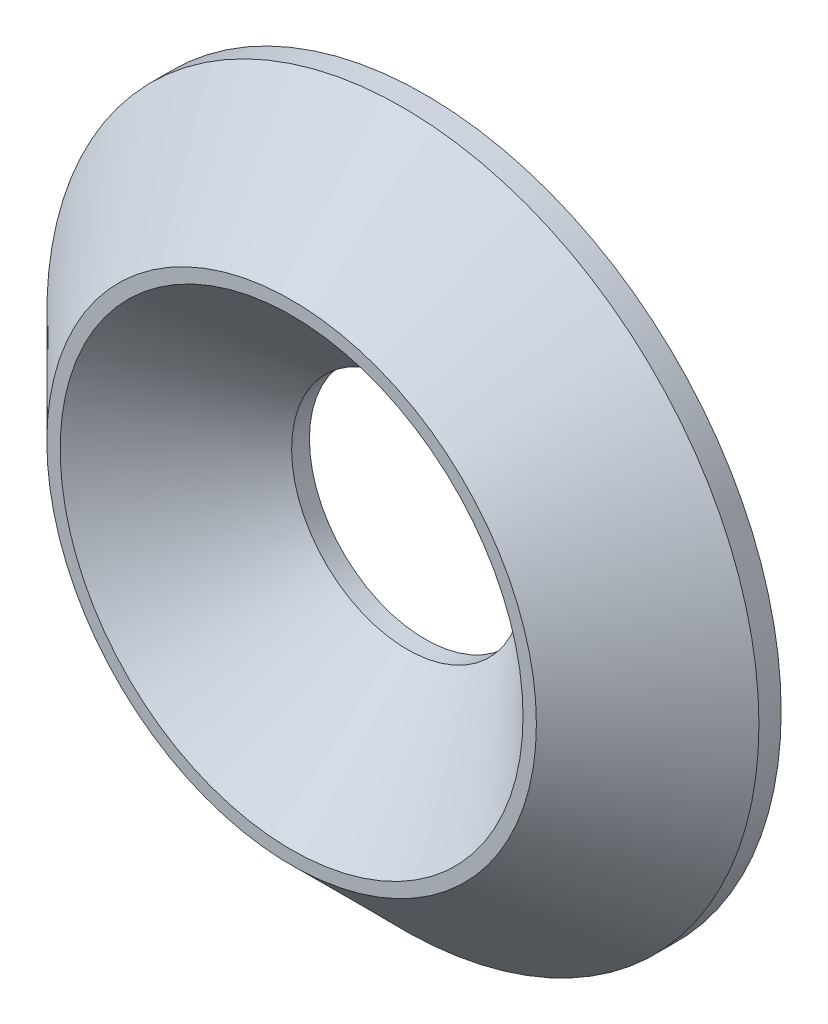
ISO-10303-21;
HEADER;
FILE_DESCRIPTION(('STEP AP214'),'2;1');
FILE_NAME('part.step','',(''),(''),'','','');
FILE_SCHEMA(('AUTOMOTIVE_DESIGN { 1 0 10303 214 1 1 1 1 }'));
ENDSEC;
DATA;
#1=APPLICATION_CONTEXT('core data for automotive mechanical design processes');
#2=APPLICATION_PROTOCOL_DEFINITION('international standard','automotive_design',2000,#1);
#3=PRODUCT_CONTEXT('',#1,'mechanical');
#4=PRODUCT('Part','Part','',(#3));
#5=PRODUCT_RELATED_PRODUCT_CATEGORY('part','',(#4));
#6=PRODUCT_DEFINITION_FORMATION('','',#4);
#7=PRODUCT_DEFINITION_CONTEXT('part definition',#1,'design');
#8=PRODUCT_DEFINITION('design','',#6,#7);
#9=PRODUCT_DEFINITION_SHAPE('','',#8);
#10=(LENGTH_UNIT() NAMED_UNIT(*) SI_UNIT(.MILLI.,.METRE.));
#11=(NAMED_UNIT(*) PLANE_ANGLE_UNIT() SI_UNIT($,.RADIAN.));
#12=(NAMED_UNIT(*) SI_UNIT($,.STERADIAN.) SOLID_ANGLE_UNIT());
#13=UNCERTAINTY_MEASURE_WITH_UNIT(LENGTH_MEASURE(1.E-05),#10,'distance_accuracy_value','');
#14=(GEOMETRIC_REPRESENTATION_CONTEXT(3) GLOBAL_UNCERTAINTY_ASSIGNED_CONTEXT((#13)) GLOBAL_UNIT_ASSIGNED_CONTEXT((#10,
#11,#12)) REPRESENTATION_CONTEXT('',''));
#15=CARTESIAN_POINT('',(0.,0.,0.));
#16=DIRECTION('',(0.,0.,1.));
#17=DIRECTION('',(1.,0.,0.));
#18=AXIS2_PLACEMENT_3D('',#15,#16,#17);
#19=CARTESIAN_POINT('',(0.,0.,3.));
#20=DIRECTION('',(0.,0.,1.));
#21=DIRECTION('',(1.,0.,0.));
#22=AXIS2_PLACEMENT_3D('',#19,#20,#21);
#23=PLANE('',#22);
#24=CARTESIAN_POINT('',(0.,0.,3.));
#25=DIRECTION('',(0.,0.,1.));
#26=DIRECTION('',(1.,0.,0.));
#27=AXIS2_PLACEMENT_3D('',#24,#25,#26);
#28=CIRCLE('',#27,5.20000000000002);
#29=CARTESIAN_POINT('',(5.20000000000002,0.,3.));
#30=VERTEX_POINT('',#29);
#31=EDGE_CURVE('E10',#30,#30,#28,.F.);
#32=ORIENTED_EDGE('',*,*,#31,.T.);
#33=EDGE_LOOP('',(#32));
#34=FACE_BOUND('',#33,.T.);
#35=CARTESIAN_POINT('',(0.,0.,3.));
#36=DIRECTION('',(0.,0.,1.));
#37=DIRECTION('',(1.,0.,0.));
#38=AXIS2_PLACEMENT_3D('',#35,#36,#37);
#39=CIRCLE('',#38,5.49999999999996);
#40=CARTESIAN_POINT('',(5.49999999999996,0.,3.));
#41=VERTEX_POINT('',#40);
#42=EDGE_CURVE('E44',#41,#41,#39,.T.);
#43=ORIENTED_EDGE('',*,*,#42,.T.);
#44=EDGE_LOOP('',(#43));
#45=FACE_BOUND('',#44,.T.);
#46=ADVANCED_FACE('F29',(#34,#45),#23,.T.);
#47=CARTESIAN_POINT('',(0.,0.,0.));
#48=DIRECTION('',(0.,0.,1.));
#49=DIRECTION('',(1.,0.,0.));
#50=AXIS2_PLACEMENT_3D('',#47,#48,#49);
#51=PLANE('',#50);
#52=CARTESIAN_POINT('',(0.,0.,0.));
#53=DIRECTION('',(0.,0.,1.));
#54=DIRECTION('',(1.,0.,0.));
#55=AXIS2_PLACEMENT_3D('',#52,#53,#54);
#56=CIRCLE('',#55,8.);
#57=CARTESIAN_POINT('',(8.00000000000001,0.,0.));
#58=VERTEX_POINT('',#57);
#59=EDGE_CURVE('E49',#58,#58,#56,.T.);
#60=ORIENTED_EDGE('',*,*,#59,.F.);
#61=EDGE_LOOP('',(#60));
#62=FACE_BOUND('',#61,.T.);
#63=CARTESIAN_POINT('',(0.,0.,0.));
#64=DIRECTION('',(0.,0.,1.));
#65=DIRECTION('',(1.,0.,0.));
#66=AXIS2_PLACEMENT_3D('',#63,#64,#65);
#67=CIRCLE('',#66,2.6);
#68=CARTESIAN_POINT('',(2.6,0.,0.));
#69=VERTEX_POINT('',#68);
#70=EDGE_CURVE('E52',#69,#69,#67,.T.);
#71=ORIENTED_EDGE('',*,*,#70,.T.);
#72=EDGE_LOOP('',(#71));
#73=FACE_BOUND('',#72,.T.);
#74=ADVANCED_FACE('F56',(#62,#73),#51,.F.);
#75=CARTESIAN_POINT('',(0.,0.,3.));
#76=DIRECTION('',(0.,0.,-1.));
#77=DIRECTION('',(-1.,0.,0.));
#78=AXIS2_PLACEMENT_3D('',#75,#76,#77);
#79=CYLINDRICAL_SURFACE('',#78,8.);
#80=CARTESIAN_POINT('',(0.,0.,0.499999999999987));
#81=DIRECTION('',(0.,0.,1.));
#82=DIRECTION('',(1.,0.,0.));
#83=AXIS2_PLACEMENT_3D('',#80,#81,#82);
#84=CIRCLE('',#83,8.);
#85=CARTESIAN_POINT('',(8.00000000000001,0.,0.499999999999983));
#86=VERTEX_POINT('',#85);
#87=EDGE_CURVE('E40',#86,#86,#84,.F.);
#88=ORIENTED_EDGE('',*,*,#87,.T.);
#89=EDGE_LOOP('',(#88));
#90=FACE_BOUND('',#89,.T.);
#91=ORIENTED_EDGE('',*,*,#59,.T.);
#92=EDGE_LOOP('',(#91));
#93=FACE_BOUND('',#92,.T.);
#94=ADVANCED_FACE('F31',(#90,#93),#79,.T.);
#95=CARTESIAN_POINT('',(0.,0.,3.));
#96=DIRECTION('',(0.,0.,-1.));
#97=DIRECTION('',(-1.,0.,0.));
#98=AXIS2_PLACEMENT_3D('',#95,#96,#97);
#99=CYLINDRICAL_SURFACE('',#98,2.6);
#100=CARTESIAN_POINT('',(0.,0.,0.399999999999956));
#101=DIRECTION('',(0.,0.,1.));
#102=DIRECTION('',(1.,0.,0.));
#103=AXIS2_PLACEMENT_3D('',#100,#101,#102);
#104=CIRCLE('',#103,2.6);
#105=CARTESIAN_POINT('',(2.6,0.,0.399999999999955));
#106=VERTEX_POINT('',#105);
#107=EDGE_CURVE('E36',#106,#106,#104,.T.);
#108=ORIENTED_EDGE('',*,*,#107,.T.);
#109=EDGE_LOOP('',(#108));
#110=FACE_BOUND('',#109,.T.);
#111=ORIENTED_EDGE('',*,*,#70,.F.);
#112=EDGE_LOOP('',(#111));
#113=FACE_BOUND('',#112,.T.);
#114=ADVANCED_FACE('F58',(#110,#113),#99,.F.);
#115=CARTESIAN_POINT('',(0.,0.,3.));
#116=DIRECTION('',(0.,0.,-1.));
#117=DIRECTION('',(-1.,0.,0.));
#118=AXIS2_PLACEMENT_3D('',#115,#116,#117);
#119=CONICAL_SURFACE('',#118,5.49999999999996,0.785398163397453);
#120=ORIENTED_EDGE('',*,*,#87,.F.);
#121=EDGE_LOOP('',(#120));
#122=FACE_BOUND('',#121,.T.);
#123=ORIENTED_EDGE('',*,*,#42,.F.);
#124=EDGE_LOOP('',(#123));
#125=FACE_BOUND('',#124,.T.);
#126=ADVANCED_FACE('F60',(#122,#125),#119,.T.);
#127=CARTESIAN_POINT('',(0.,0.,0.399999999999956));
#128=DIRECTION('',(0.,0.,1.));
#129=DIRECTION('',(1.,0.,0.));
#130=AXIS2_PLACEMENT_3D('',#127,#128,#129);
#131=CONICAL_SURFACE('',#130,2.6,0.785398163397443);
#132=ORIENTED_EDGE('',*,*,#31,.F.);
#133=EDGE_LOOP('',(#132));
#134=FACE_BOUND('',#133,.T.);
#135=ORIENTED_EDGE('',*,*,#107,.F.);
#136=EDGE_LOOP('',(#135));
#137=FACE_BOUND('',#136,.T.);
#138=ADVANCED_FACE('F66',(#134,#137),#131,.F.);
#139=CLOSED_SHELL('',(#46,#74,#94,#114,#126,#138));
#140=MANIFOLD_SOLID_BREP('B2',#139);
#141=ADVANCED_BREP_SHAPE_REPRESENTATION('',(#18,#140),#14);
#142=SHAPE_DEFINITION_REPRESENTATION(#9,#141);
ENDSEC;
END-ISO-10303-21;
